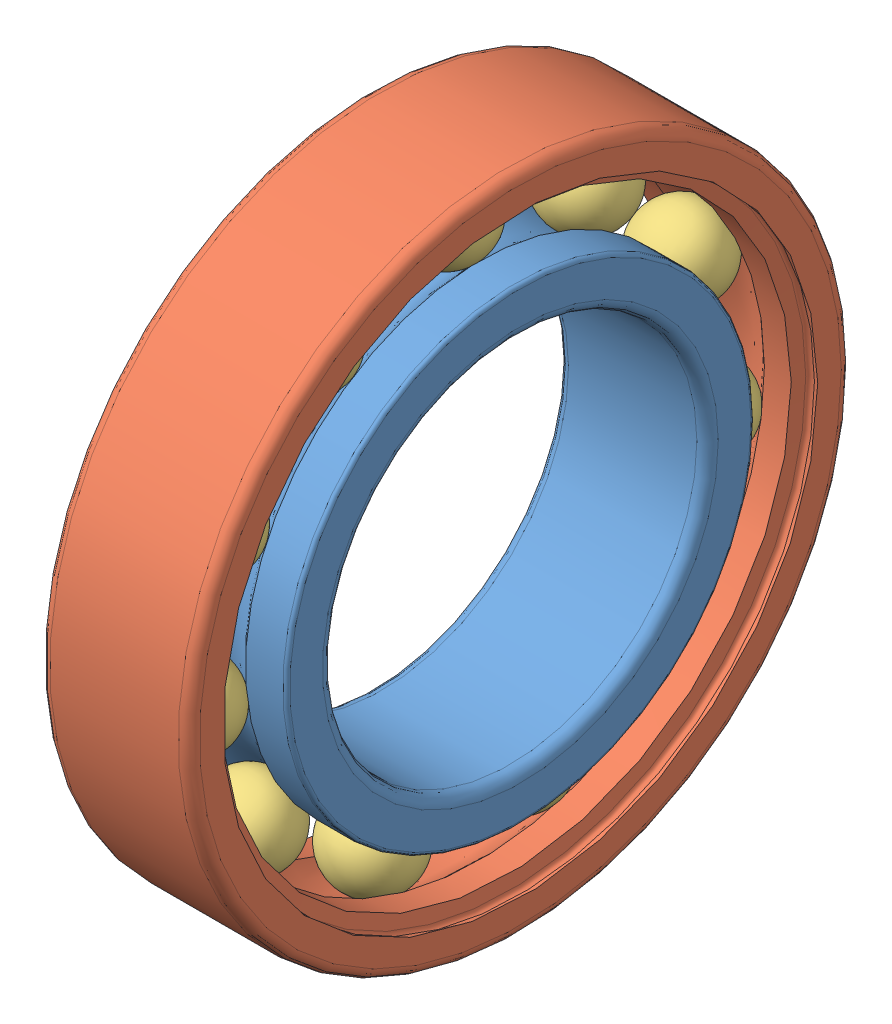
SolidWorks assembly 06 Roulement type BC 35x62x14.sldasm, configuration Défaut (file format 4700). Lengths in mm.
Overall size (14 62 62).
13 component instances, 3 part files, 0 mates.
Components (placement in the parent):
- Bague int-11 Roulement type BC 35x62x14-1: Bague int-11 Roulement type BC 35x62x14.sldprt [Défaut] at origin size (14 43.8 43.8)
- Bague ext-11 Roulement type BC 35x62x14-1: Bague ext-11 Roulement type BC 35x62x14.sldprt [Défaut] at origin size (14 62 62)
- Bille-11 Roulement type BC 35x62x14-1: Bille-11 Roulement type BC 35x62x14.sldprt [Défaut] at origin size (7.94 7.94 7.94)
- Bille-11 Roulement type BC 35x62x14-2: Bille-11 Roulement type BC 35x62x14.sldprt [Défaut] x (1 0 0) z (0 0.540641 0.841254) size (7.94 7.94 7.94)
- Bille-11 Roulement type BC 35x62x14-3: Bille-11 Roulement type BC 35x62x14.sldprt [Défaut] x (1 0 0) z (0 0.909632 0.415415) size (7.94 7.94 7.94)
- Bille-11 Roulement type BC 35x62x14-4: Bille-11 Roulement type BC 35x62x14.sldprt [Défaut] x (1 0 0) z (0 0.989821 -0.142315) size (7.94 7.94 7.94)
- Bille-11 Roulement type BC 35x62x14-5: Bille-11 Roulement type BC 35x62x14.sldprt [Défaut] x (1 0 0) z (0 0.75575 -0.654861) size (7.94 7.94 7.94)
- Bille-11 Roulement type BC 35x62x14-6: Bille-11 Roulement type BC 35x62x14.sldprt [Défaut] x (1 0 0) z (0 0.281733 -0.959493) size (7.94 7.94 7.94)
- Bille-11 Roulement type BC 35x62x14-7: Bille-11 Roulement type BC 35x62x14.sldprt [Défaut] x (1 0 0) z (0 -0.281733 -0.959493) size (7.94 7.94 7.94)
- Bille-11 Roulement type BC 35x62x14-8: Bille-11 Roulement type BC 35x62x14.sldprt [Défaut] x (1 0 0) z (0 -0.75575 -0.654861) size (7.94 7.94 7.94)
- Bille-11 Roulement type BC 35x62x14-9: Bille-11 Roulement type BC 35x62x14.sldprt [Défaut] x (1 0 0) z (0 -0.989821 -0.142315) size (7.94 7.94 7.94)
- Bille-11 Roulement type BC 35x62x14-10: Bille-11 Roulement type BC 35x62x14.sldprt [Défaut] x (1 0 0) z (0 -0.909632 0.415415) size (7.94 7.94 7.94)
- Bille-11 Roulement type BC 35x62x14-11: Bille-11 Roulement type BC 35x62x14.sldprt [Défaut] x (1 0 0) z (0 -0.540641 0.841254) size (7.94 7.94 7.94)
